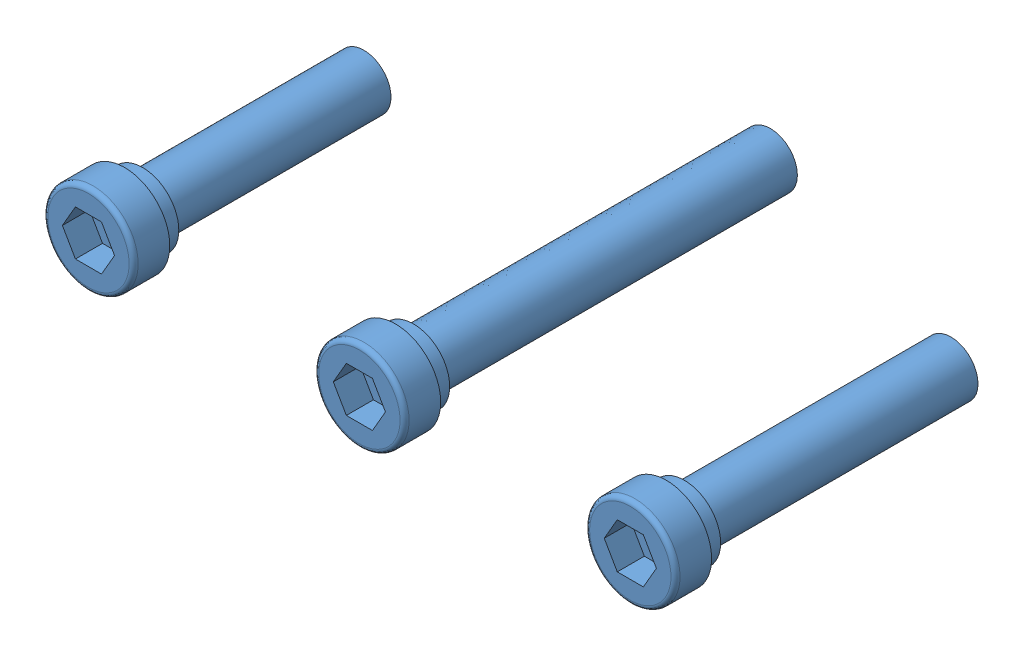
SolidWorks assembly MUSTER_KONFIG.SLDASM, configuration Standard (file format 3400). Lengths in mm.
Overall size (70 10 46).
3 component instances, 1 part files, 0 mates.
Components (placement in the parent):
- M6 x 25 DIN 912-1: M6 x 25 DIN 912.SLDPRT [30] at origin size (10 10 36)
- M6 x 25 DIN 912-2: M6 x 25 DIN 912.SLDPRT [40] at (-30 0 0) size (10 10 46)
- M6 x 25 DIN 912-3: M6 x 25 DIN 912.SLDPRT [Standard] at (-60 0 0) size (10 10 31)
